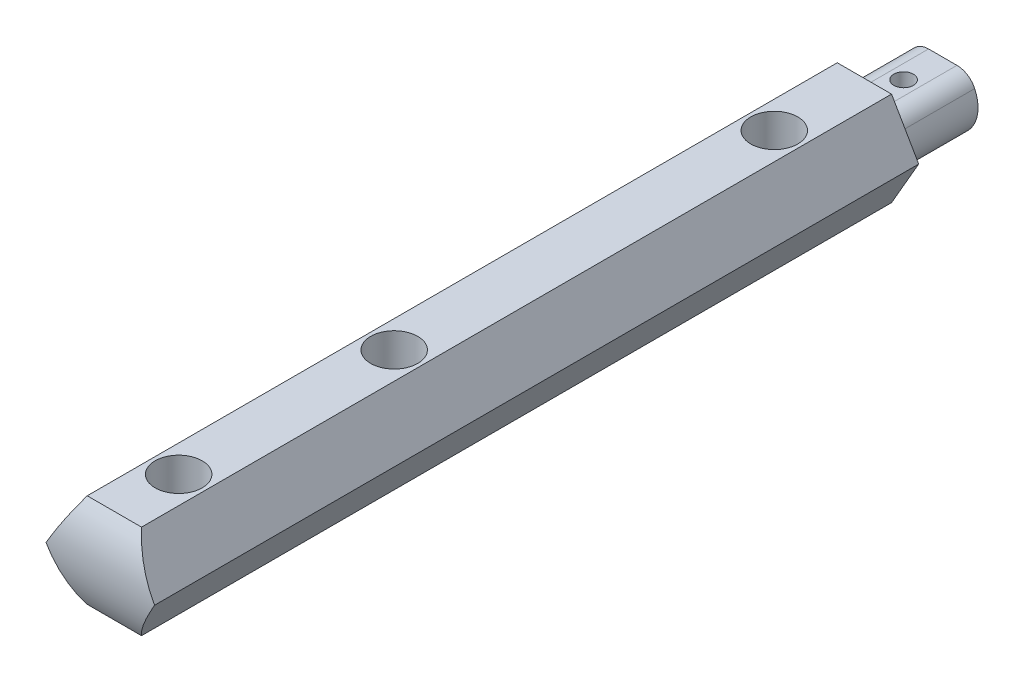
from build123d import *

# Parameters (mm, degrees)
EXTRUDE_1_DEPTH          = 195
EXTRUDE_2_DEPTH          = 20
CUT_EXTRUDE_2_DEPTH      = 196.859643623
CUT_EXTRUDE_2_DEPTH_BACK = 196.859643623
PATTERN_LINEAR_1_COUNT   = 2
PATTERN_LINEAR_1_PITCH   = 55
HOLE_WIZARD_M6_1_D       = 5


with BuildPart() as part:
    # Sketch 1 → Extrude 1 (new body)
    with BuildSketch(Plane.XY):
        Polygon((-13.856406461, 0), (-6.92820323, -12), (6.92820323, -12), (13.856406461, 0), (6.92820323, 12), (-6.92820323, 12), align=None)
    extrude(amount=EXTRUDE_1_DEPTH)

    # Sketch 2 → Extrude 2 (add)
    with BuildSketch(Plane(origin=(0, 0, 0), x_dir=(-1, 0, 0), z_dir=(0, 0, -1))):
        with BuildLine():
            Line((-3.620773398, 6.7), (3.620773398, 6.7))
            ThreePointArc((3.620773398, 6.7), (6.301724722, 5.920485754), (8.146740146, 3.825))
            ThreePointArc((8.146740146, 3.825), (0, -9), (-8.146740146, 3.825))
            ThreePointArc((-8.146740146, 3.825), (-6.301724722, 5.920485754), (-3.620773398, 6.7))
        make_face()
    extrude(amount=EXTRUDE_2_DEPTH)

    # Sketch 3 → Cut-Extrude 2 (cut, two sides: drawn at the far end of the back side and taken through both)
    with BuildSketch(Plane(origin=(0, 0, 0), x_dir=(0, 0, -1), z_dir=(1, 0, 0)).offset(-CUT_EXTRUDE_2_DEPTH_BACK)):
        with BuildLine():
            Line((-191.409209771, 12), (-211.674723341, 15.216448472))
            Line((-211.674723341, 15.216448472), (-211.674723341, -17.769809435))
            Line((-211.674723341, -17.769809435), (-191.409209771, -12))
            ThreePointArc((-191.409209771, -12), (-195, 0), (-191.409209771, 12))
        make_face()
    extrude(amount=CUT_EXTRUDE_2_DEPTH + CUT_EXTRUDE_2_DEPTH_BACK, mode=Mode.SUBTRACT)

    # Sketch 8 → Cut-Revolve 2 (revolve, cut)
    with BuildSketch(Plane(origin=(0, 0, 0), x_dir=(0, 0, -1), z_dir=(1, 0, 0))):
        Polygon((-169, 12), (-169, 0), (-170.994449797, 0), (-170.994449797, -12), (-175, -12), (-175, 12), align=None)
    cut_revolve_2 = revolve(axis=Axis((0, -12, 175), (0, 1, 0)), mode=Mode.SUBTRACT)

    # Pattern Linear 1: Cut-Revolve 2 ×2
    with Locations(*[(0, 0, -i * PATTERN_LINEAR_1_PITCH) for i in range(1, PATTERN_LINEAR_1_COUNT)]):
        add(cut_revolve_2, mode=Mode.SUBTRACT)

    # Sketch 12 → Cut-Revolve 3 (revolve, cut)
    with BuildSketch(Plane(origin=(0, 0, 0), x_dir=(0, 0, -1), z_dir=(1, 0, 0))):
        Polygon((-23, 12), (-29, 12), (-29, -3), (-26.25, -3), (-26.25, -12), (-23, -12), align=None)
    revolve(axis=Axis((0, 21.512924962, 23), (0, -1, 0)), mode=Mode.SUBTRACT)

    # Hole Wizard M6 _1 (through all)
    with Locations(Plane(origin=(0, 6.7, 0), x_dir=(1, 0, 0), z_dir=(0, 1, 0))):
        with Locations((0, 10)):
            Hole(HOLE_WIZARD_M6_1_D / 2)


solid = part.part
